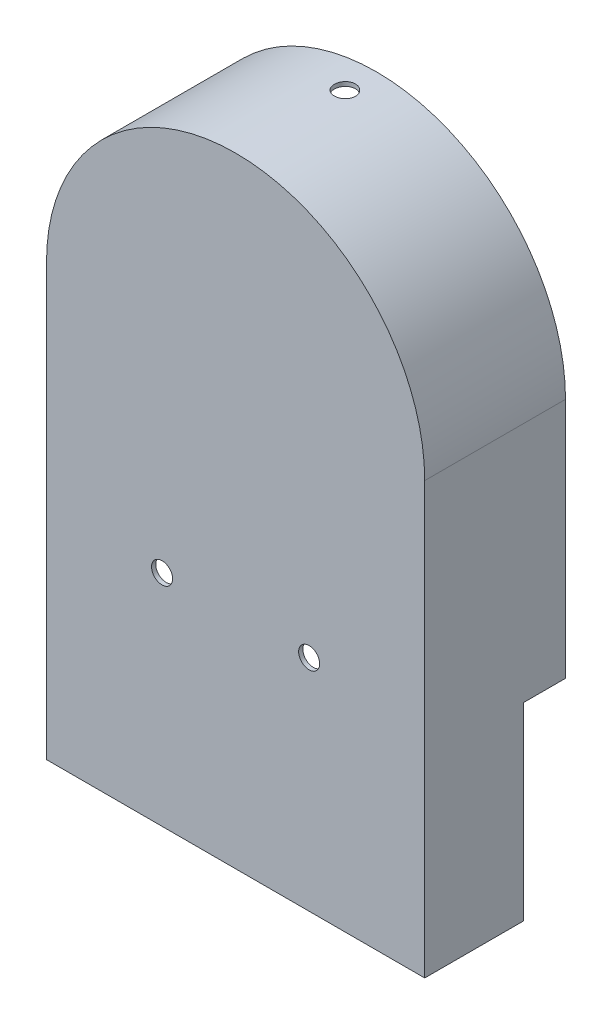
ISO-10303-21;
HEADER;
FILE_DESCRIPTION(('STEP AP214'),'2;1');
FILE_NAME('part.step','',(''),(''),'','','');
FILE_SCHEMA(('AUTOMOTIVE_DESIGN { 1 0 10303 214 1 1 1 1 }'));
ENDSEC;
DATA;
#1=APPLICATION_CONTEXT('core data for automotive mechanical design processes');
#2=APPLICATION_PROTOCOL_DEFINITION('international standard','automotive_design',2000,#1);
#3=PRODUCT_CONTEXT('',#1,'mechanical');
#4=PRODUCT('Part','Part','',(#3));
#5=PRODUCT_RELATED_PRODUCT_CATEGORY('part','',(#4));
#6=PRODUCT_DEFINITION_FORMATION('','',#4);
#7=PRODUCT_DEFINITION_CONTEXT('part definition',#1,'design');
#8=PRODUCT_DEFINITION('design','',#6,#7);
#9=PRODUCT_DEFINITION_SHAPE('','',#8);
#10=(LENGTH_UNIT() NAMED_UNIT(*) SI_UNIT(.MILLI.,.METRE.));
#11=(NAMED_UNIT(*) PLANE_ANGLE_UNIT() SI_UNIT($,.RADIAN.));
#12=(NAMED_UNIT(*) SI_UNIT($,.STERADIAN.) SOLID_ANGLE_UNIT());
#13=UNCERTAINTY_MEASURE_WITH_UNIT(LENGTH_MEASURE(1.E-05),#10,'distance_accuracy_value','');
#14=(GEOMETRIC_REPRESENTATION_CONTEXT(3) GLOBAL_UNCERTAINTY_ASSIGNED_CONTEXT((#13)) GLOBAL_UNIT_ASSIGNED_CONTEXT((#10,
#11,#12)) REPRESENTATION_CONTEXT('',''));
#15=CARTESIAN_POINT('',(0.,0.,0.));
#16=DIRECTION('',(0.,0.,1.));
#17=DIRECTION('',(1.,0.,0.));
#18=AXIS2_PLACEMENT_3D('',#15,#16,#17);
#19=CARTESIAN_POINT('',(0.,0.,2.));
#20=DIRECTION('',(0.,0.,-1.));
#21=DIRECTION('',(-1.,0.,0.));
#22=AXIS2_PLACEMENT_3D('',#19,#20,#21);
#23=CYLINDRICAL_SURFACE('',#22,90.);
#24=DIRECTION('',(0.,0.,-1.));
#25=VECTOR('',#24,1.);
#26=CARTESIAN_POINT('',(90.,0.,2.));
#27=LINE('',#26,#25);
#28=CARTESIAN_POINT('',(90.,0.,2.));
#29=VERTEX_POINT('',#28);
#30=CARTESIAN_POINT('',(90.,0.,-65.));
#31=VERTEX_POINT('',#30);
#32=EDGE_CURVE('E149',#29,#31,#27,.T.);
#33=ORIENTED_EDGE('',*,*,#32,.T.);
#34=CARTESIAN_POINT('',(0.,0.,-65.));
#35=DIRECTION('',(0.,0.,-1.));
#36=DIRECTION('',(-1.,0.,0.));
#37=AXIS2_PLACEMENT_3D('',#34,#35,#36);
#38=CIRCLE('',#37,90.);
#39=CARTESIAN_POINT('',(-90.,0.,-65.));
#40=VERTEX_POINT('',#39);
#41=EDGE_CURVE('E218',#40,#31,#38,.T.);
#42=ORIENTED_EDGE('',*,*,#41,.F.);
#43=DIRECTION('',(0.,0.,-1.));
#44=VECTOR('',#43,1.);
#45=CARTESIAN_POINT('',(-90.,0.,2.));
#46=LINE('',#45,#44);
#47=CARTESIAN_POINT('',(-90.,0.,2.));
#48=VERTEX_POINT('',#47);
#49=EDGE_CURVE('E144',#48,#40,#46,.T.);
#50=ORIENTED_EDGE('',*,*,#49,.F.);
#51=CARTESIAN_POINT('',(0.,0.,2.));
#52=DIRECTION('',(0.,0.,1.));
#53=DIRECTION('',(1.,0.,0.));
#54=AXIS2_PLACEMENT_3D('',#51,#52,#53);
#55=CIRCLE('',#54,90.);
#56=EDGE_CURVE('E224',#29,#48,#55,.T.);
#57=ORIENTED_EDGE('',*,*,#56,.F.);
#58=EDGE_LOOP('',(#33,#42,#50,#57));
#59=FACE_BOUND('',#58,.T.);
#60=CARTESIAN_POINT('',(0.,90.,-55.));
#61=CARTESIAN_POINT('',(-0.140360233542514,90.0000001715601,-55.0000011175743));
#62=CARTESIAN_POINT('',(-0.280702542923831,89.999670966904,-54.9940873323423));
#63=CARTESIAN_POINT('',(-0.560434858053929,89.9983637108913,-54.9704742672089));
#64=CARTESIAN_POINT('',(-0.699824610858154,89.9973854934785,-54.952771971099));
#65=CARTESIAN_POINT('',(-0.976731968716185,89.9948064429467,-54.9056841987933));
#66=CARTESIAN_POINT('',(-1.11424785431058,89.993205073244,-54.8762886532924));
#67=CARTESIAN_POINT('',(-1.38635929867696,89.989424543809,-54.8060129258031));
#68=CARTESIAN_POINT('',(-1.52095377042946,89.9872451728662,-54.7651285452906));
#69=CARTESIAN_POINT('',(-1.78609486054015,89.9823729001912,-54.6722137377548));
#70=CARTESIAN_POINT('',(-1.91664495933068,89.9796804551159,-54.6201932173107));
#71=CARTESIAN_POINT('',(-2.17294420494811,89.9738559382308,-54.5053347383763));
#72=CARTESIAN_POINT('',(-2.29869156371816,89.9707237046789,-54.4424927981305));
#73=CARTESIAN_POINT('',(-2.54436938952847,89.9641110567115,-54.3064934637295));
#74=CARTESIAN_POINT('',(-2.66430332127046,89.9606308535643,-54.2333423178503));
#75=CARTESIAN_POINT('',(-2.89763110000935,89.9534177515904,-54.0771862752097));
#76=CARTESIAN_POINT('',(-3.01102251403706,89.9496847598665,-53.9941777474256));
#77=CARTESIAN_POINT('',(-3.23049240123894,89.9420701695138,-53.8188556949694));
#78=CARTESIAN_POINT('',(-3.33656571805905,89.9381884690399,-53.7265357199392));
#79=CARTESIAN_POINT('',(-3.54059957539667,89.9303874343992,-53.53325749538));
#80=CARTESIAN_POINT('',(-3.63855710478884,89.926468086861,-53.4322960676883));
#81=CARTESIAN_POINT('',(-3.82559084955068,89.9187055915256,-53.2225138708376));
#82=CARTESIAN_POINT('',(-3.91466996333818,89.9148624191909,-53.1136956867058));
#83=CARTESIAN_POINT('',(-4.08338293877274,89.9073585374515,-52.8888995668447));
#84=CARTESIAN_POINT('',(-4.16301330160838,89.9036978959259,-52.7729190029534));
#85=CARTESIAN_POINT('',(-4.31224433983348,89.8966636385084,-52.5346235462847));
#86=CARTESIAN_POINT('',(-4.38184235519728,89.8932900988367,-52.4123069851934));
#87=CARTESIAN_POINT('',(-4.51051122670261,89.8869258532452,-52.1621927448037));
#88=CARTESIAN_POINT('',(-4.56957818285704,89.8839352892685,-52.0343930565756));
#89=CARTESIAN_POINT('',(-4.67671111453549,89.8784248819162,-51.7742988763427));
#90=CARTESIAN_POINT('',(-4.72478122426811,89.8759048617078,-51.6420060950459));
#91=CARTESIAN_POINT('',(-4.80961883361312,89.8714044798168,-51.3738214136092));
#92=CARTESIAN_POINT('',(-4.8463821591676,89.8694243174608,-51.2379282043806));
#93=CARTESIAN_POINT('',(-4.93916268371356,89.8643907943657,-50.8266749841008));
#94=CARTESIAN_POINT('',(-4.9778995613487,89.8622322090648,-50.5471835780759));
#95=CARTESIAN_POINT('',(-5.00788626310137,89.8605656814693,-49.9858093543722));
#96=CARTESIAN_POINT('',(-4.99913652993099,89.8610577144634,-49.7039265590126));
#97=CARTESIAN_POINT('',(-4.93450003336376,89.8646301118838,-49.1459148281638));
#98=CARTESIAN_POINT('',(-4.87866553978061,89.8677076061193,-48.8697798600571));
#99=CARTESIAN_POINT('',(-4.72150904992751,89.8761007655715,-48.3308188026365));
#100=CARTESIAN_POINT('',(-4.62018682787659,89.8814164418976,-48.0679927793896));
#101=CARTESIAN_POINT('',(-4.37487588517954,89.8936898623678,-47.5629287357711));
#102=CARTESIAN_POINT('',(-4.23086337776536,89.9006485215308,-47.320702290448));
#103=CARTESIAN_POINT('',(-3.9042759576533,89.9154228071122,-46.8638434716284));
#104=CARTESIAN_POINT('',(-3.72170070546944,89.9232384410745,-46.6492113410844));
#105=CARTESIAN_POINT('',(-3.32287594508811,89.9388585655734,-46.2533285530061));
#106=CARTESIAN_POINT('',(-3.10658117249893,89.9466630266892,-46.0721234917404));
#107=CARTESIAN_POINT('',(-2.64661601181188,89.9613710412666,-45.7485903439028));
#108=CARTESIAN_POINT('',(-2.40294561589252,89.9682745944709,-45.6062622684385));
#109=CARTESIAN_POINT('',(-1.89511905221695,89.9804032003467,-45.3645273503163));
#110=CARTESIAN_POINT('',(-1.63096209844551,89.9856281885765,-45.2651221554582));
#111=CARTESIAN_POINT('',(-1.08967290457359,89.9938099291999,-45.1120848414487));
#112=CARTESIAN_POINT('',(-0.81254078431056,89.9967667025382,-45.0584522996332));
#113=CARTESIAN_POINT('',(-0.253563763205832,90.0000761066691,-44.9985390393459));
#114=CARTESIAN_POINT('',(0.0282743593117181,90.0004322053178,-44.9921952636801));
#115=CARTESIAN_POINT('',(0.589010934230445,89.9985093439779,-45.0268749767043));
#116=CARTESIAN_POINT('',(0.867909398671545,89.9962303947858,-45.0678982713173));
#117=CARTESIAN_POINT('',(1.41467267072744,89.9892962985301,-45.1960954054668));
#118=CARTESIAN_POINT('',(1.68254426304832,89.9846426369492,-45.2832403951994));
#119=CARTESIAN_POINT('',(2.1998590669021,89.9734828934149,-45.5011779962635));
#120=CARTESIAN_POINT('',(2.4493021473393,89.9669767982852,-45.6319709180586));
#121=CARTESIAN_POINT('',(2.92296839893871,89.9528350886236,-45.9336524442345));
#122=CARTESIAN_POINT('',(3.14716465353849,89.9451982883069,-46.1045832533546));
#123=CARTESIAN_POINT('',(3.56370226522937,89.9296589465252,-46.4816278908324));
#124=CARTESIAN_POINT('',(3.75604337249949,89.9217564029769,-46.687741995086));
#125=CARTESIAN_POINT('',(4.10362407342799,89.9065662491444,-47.1295702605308));
#126=CARTESIAN_POINT('',(4.25882282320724,89.8992793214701,-47.3653165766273));
#127=CARTESIAN_POINT('',(4.52743255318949,89.8861531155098,-47.8595691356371));
#128=CARTESIAN_POINT('',(4.64084374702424,89.8803138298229,-48.1180752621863));
#129=CARTESIAN_POINT('',(4.8225935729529,89.8707455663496,-48.6503068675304));
#130=CARTESIAN_POINT('',(4.89095810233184,89.8670153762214,-48.9240235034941));
#131=CARTESIAN_POINT('',(4.9807379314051,89.8620852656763,-49.4792243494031));
#132=CARTESIAN_POINT('',(5.00215358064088,89.8608853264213,-49.7607085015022));
#133=CARTESIAN_POINT('',(4.99866262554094,89.8610775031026,-50.1821650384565));
#134=CARTESIAN_POINT('',(4.99156669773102,89.8614733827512,-50.3225028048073));
#135=CARTESIAN_POINT('',(4.96560006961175,89.8629123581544,-50.6020673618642));
#136=CARTESIAN_POINT('',(4.94673372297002,89.863955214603,-50.7412945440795));
#137=CARTESIAN_POINT('',(4.89734707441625,89.8666600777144,-51.017703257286));
#138=CARTESIAN_POINT('',(4.86682246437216,89.8683223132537,-51.1548840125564));
#139=CARTESIAN_POINT('',(4.79435436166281,89.8722175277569,-51.4261356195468));
#140=CARTESIAN_POINT('',(4.7524150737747,89.8744502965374,-51.5602075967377));
#141=CARTESIAN_POINT('',(4.65739412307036,89.8794244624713,-51.8243885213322));
#142=CARTESIAN_POINT('',(4.60430835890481,89.8821660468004,-51.9544959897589));
#143=CARTESIAN_POINT('',(4.48740416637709,89.8880783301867,-52.2097282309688));
#144=CARTESIAN_POINT('',(4.42358969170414,89.8912488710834,-52.3348548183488));
#145=CARTESIAN_POINT('',(4.28564477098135,89.8979311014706,-52.579332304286));
#146=CARTESIAN_POINT('',(4.21151084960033,89.9014429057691,-52.698681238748));
#147=CARTESIAN_POINT('',(4.05349867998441,89.9087059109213,-52.9306719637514));
#148=CARTESIAN_POINT('',(3.96962401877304,89.912457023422,-53.0433162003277));
#149=CARTESIAN_POINT('',(3.79255941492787,89.9200998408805,-53.2613256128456));
#150=CARTESIAN_POINT('',(3.69935468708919,89.9239917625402,-53.366678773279));
#151=CARTESIAN_POINT('',(3.5044397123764,89.9317986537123,-53.5691230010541));
#152=CARTESIAN_POINT('',(3.40273260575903,89.9357136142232,-53.6662170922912));
#153=CARTESIAN_POINT('',(3.19143798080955,89.9434594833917,-53.8515561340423));
#154=CARTESIAN_POINT('',(3.08184565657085,89.9472903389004,-53.9397956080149));
#155=CARTESIAN_POINT('',(2.855654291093,89.9547554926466,-54.1067001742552));
#156=CARTESIAN_POINT('',(2.7390578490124,89.9583898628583,-54.1853687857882));
#157=CARTESIAN_POINT('',(2.4994738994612,89.9653656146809,-54.33271698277));
#158=CARTESIAN_POINT('',(2.37647740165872,89.9687065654,-54.40138197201));
#159=CARTESIAN_POINT('',(2.12516973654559,89.974993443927,-54.5280733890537));
#160=CARTESIAN_POINT('',(1.99686053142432,89.9779395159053,-54.586103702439));
#161=CARTESIAN_POINT('',(1.73590822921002,89.9833519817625,-54.6910961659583));
#162=CARTESIAN_POINT('',(1.603269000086,89.9858187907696,-54.7380679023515));
#163=CARTESIAN_POINT('',(1.33454052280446,89.9902053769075,-54.8206597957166));
#164=CARTESIAN_POINT('',(1.19845217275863,89.9921252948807,-54.8562828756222));
#165=CARTESIAN_POINT('',(0.886966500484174,89.995797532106,-54.9239235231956));
#166=CARTESIAN_POINT('',(0.71079278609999,89.9973676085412,-54.9524270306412));
#167=CARTESIAN_POINT('',(0.356403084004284,89.9994687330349,-54.9904645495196));
#168=CARTESIAN_POINT('',(0.178187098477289,89.9999997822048,-54.9999985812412));
#169=CARTESIAN_POINT('',(0.,90.,-55.));
#170=B_SPLINE_CURVE_WITH_KNOTS('',3,(#60,#61,#62,#63,#64,#65,#66,#67,#68,#69,#70,#71,#72,#73,
#74,#75,#76,#77,#78,#79,#80,#81,#82,#83,#84,#85,#86,#87,#88,#89,#90,#91,#92,#93,#94,#95,#96,#97,
#98,#99,#100,#101,#102,#103,#104,#105,#106,#107,#108,#109,#110,#111,#112,#113,#114,#115,#116,
#117,#118,#119,#120,#121,#122,#123,#124,#125,#126,#127,#128,#129,#130,#131,#132,#133,#134,#135,
#136,#137,#138,#139,#140,#141,#142,#143,#144,#145,#146,#147,#148,#149,#150,#151,#152,#153,#154,
#155,#156,#157,#158,#159,#160,#161,#162,#163,#164,#165,#166,#167,#168,#169),.UNSPECIFIED.,.T.,
.F.,(4,2,2,2,2,2,2,2,2,2,2,2,2,2,2,2,2,2,2,2,2,2,2,2,2,2,2,2,2,2,2,2,2,2,2,2,2,2,2,2,2,2,2,2,2,
2,2,2,2,2,2,2,2,2,4),(0.,0.420925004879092,0.841957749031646,1.26335384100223,1.68490413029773,
2.10608096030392,2.52741309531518,2.94849095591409,3.36972440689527,3.79125169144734,
4.21293467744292,4.63447954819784,5.05618003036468,5.47799211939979,5.89996009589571,
6.32176917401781,6.74373378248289,7.58587641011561,8.4280111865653,9.26921231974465,
10.1104176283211,10.9520925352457,11.7937748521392,12.6365969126,13.4794192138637,
14.3222738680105,15.1651207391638,16.0068435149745,16.8485628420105,17.6897562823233,
18.5309557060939,19.3730436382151,20.2151381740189,21.0581545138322,21.9011665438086,
22.7436935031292,23.5862141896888,24.0073574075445,24.4283449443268,24.8494882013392,
25.2704765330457,25.69162003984,26.1126086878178,26.5337394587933,26.9547156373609,
27.3763698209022,27.7978689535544,28.2196271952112,28.6412298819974,29.0634416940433,
29.4854989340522,29.9071889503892,30.3287702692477,30.8631344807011,31.3974981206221),.UNSPECIFIED.);
#171=CARTESIAN_POINT('',(0.,90.,-55.));
#172=VERTEX_POINT('',#171);
#173=EDGE_CURVE('E164',#172,#172,#170,.T.);
#174=ORIENTED_EDGE('',*,*,#173,.F.);
#175=EDGE_LOOP('',(#174));
#176=FACE_BOUND('',#175,.T.);
#177=ADVANCED_FACE('F24',(#59,#176),#23,.T.);
#178=CARTESIAN_POINT('',(0.,0.,-65.));
#179=DIRECTION('',(0.,0.,1.));
#180=DIRECTION('',(1.,0.,0.));
#181=AXIS2_PLACEMENT_3D('',#178,#179,#180);
#182=CYLINDRICAL_SURFACE('',#181,88.);
#183=CARTESIAN_POINT('',(0.,0.,0.));
#184=DIRECTION('',(0.,0.,-1.));
#185=DIRECTION('',(-1.,0.,0.));
#186=AXIS2_PLACEMENT_3D('',#183,#184,#185);
#187=CIRCLE('',#186,88.);
#188=CARTESIAN_POINT('',(-88.,0.,0.));
#189=VERTEX_POINT('',#188);
#190=CARTESIAN_POINT('',(88.,0.,0.));
#191=VERTEX_POINT('',#190);
#192=EDGE_CURVE('E195',#189,#191,#187,.T.);
#193=ORIENTED_EDGE('',*,*,#192,.F.);
#194=DIRECTION('',(0.,0.,1.));
#195=VECTOR('',#194,1.);
#196=CARTESIAN_POINT('',(-88.,0.,-65.));
#197=LINE('',#196,#195);
#198=CARTESIAN_POINT('',(-88.,0.,-65.));
#199=VERTEX_POINT('',#198);
#200=EDGE_CURVE('E212',#199,#189,#197,.T.);
#201=ORIENTED_EDGE('',*,*,#200,.F.);
#202=CARTESIAN_POINT('',(0.,0.,-65.));
#203=DIRECTION('',(0.,0.,-1.));
#204=DIRECTION('',(-1.,0.,0.));
#205=AXIS2_PLACEMENT_3D('',#202,#203,#204);
#206=CIRCLE('',#205,88.);
#207=CARTESIAN_POINT('',(88.,0.,-65.));
#208=VERTEX_POINT('',#207);
#209=EDGE_CURVE('E203',#199,#208,#206,.T.);
#210=ORIENTED_EDGE('',*,*,#209,.T.);
#211=DIRECTION('',(0.,0.,1.));
#212=VECTOR('',#211,1.);
#213=CARTESIAN_POINT('',(88.,0.,-65.));
#214=LINE('',#213,#212);
#215=EDGE_CURVE('E210',#208,#191,#214,.T.);
#216=ORIENTED_EDGE('',*,*,#215,.T.);
#217=EDGE_LOOP('',(#193,#201,#210,#216));
#218=FACE_BOUND('',#217,.T.);
#219=CARTESIAN_POINT('',(0.,88.,-55.));
#220=CARTESIAN_POINT('',(-0.140354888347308,88.0000001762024,-55.0000011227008));
#221=CARTESIAN_POINT('',(-0.280691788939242,87.9996635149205,-54.9940877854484));
#222=CARTESIAN_POINT('',(-0.560413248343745,87.9983266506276,-54.9704765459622));
#223=CARTESIAN_POINT('',(-0.699797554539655,87.9973262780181,-54.9527756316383));
#224=CARTESIAN_POINT('',(-0.976693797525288,87.9946888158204,-54.9056916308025));
#225=CARTESIAN_POINT('',(-1.11420401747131,87.9930511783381,-54.8762984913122));
#226=CARTESIAN_POINT('',(-1.3863041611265,87.9891850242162,-54.8060286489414));
#227=CARTESIAN_POINT('',(-1.52089299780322,87.9869562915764,-54.7651477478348));
#228=CARTESIAN_POINT('',(-1.78602270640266,87.98197366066,-54.6722411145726));
#229=CARTESIAN_POINT('',(-1.91656706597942,87.9792202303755,-54.6202253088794));
#230=CARTESIAN_POINT('',(-2.17285514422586,87.9732637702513,-54.5053774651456));
#231=CARTESIAN_POINT('',(-2.29859707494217,87.9700605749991,-54.4425414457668));
#232=CARTESIAN_POINT('',(-2.54426465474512,87.9632980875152,-54.3065550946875));
#233=CARTESIAN_POINT('',(-2.66419376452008,87.9597390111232,-54.233411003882));
#234=CARTESIAN_POINT('',(-2.8975126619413,87.952362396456,-54.0772701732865));
#235=CARTESIAN_POINT('',(-3.01090001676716,87.9485447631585,-53.9942698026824));
#236=CARTESIAN_POINT('',(-3.23036763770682,87.9407572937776,-53.8189611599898));
#237=CARTESIAN_POINT('',(-3.33644242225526,87.936787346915,-53.7266460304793));
#238=CARTESIAN_POINT('',(-3.54047971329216,87.9288088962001,-53.5333775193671));
#239=CARTESIAN_POINT('',(-3.63843920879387,87.9248003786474,-53.4324209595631));
#240=CARTESIAN_POINT('',(-3.82547749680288,87.9168612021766,-53.2226483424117));
#241=CARTESIAN_POINT('',(-3.91455918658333,87.9129305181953,-53.1138348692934));
#242=CARTESIAN_POINT('',(-4.08327796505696,87.905255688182,-52.889047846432));
#243=CARTESIAN_POINT('',(-4.16291155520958,87.9015116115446,-52.7730716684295));
#244=CARTESIAN_POINT('',(-4.31215194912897,87.8943168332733,-52.5347808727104));
#245=CARTESIAN_POINT('',(-4.38175578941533,87.8908662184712,-52.4124643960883));
#246=CARTESIAN_POINT('',(-4.51043624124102,87.8843564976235,-52.1623493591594));
#247=CARTESIAN_POINT('',(-4.56950895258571,87.8812975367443,-52.0345487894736));
#248=CARTESIAN_POINT('',(-4.67665315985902,87.875661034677,-51.7744518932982));
#249=CARTESIAN_POINT('',(-4.7247287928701,87.8730833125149,-51.6421572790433));
#250=CARTESIAN_POINT('',(-4.80957707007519,87.8684798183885,-51.373968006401));
#251=CARTESIAN_POINT('',(-4.84634554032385,87.8664542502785,-51.238072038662));
#252=CARTESIAN_POINT('',(-4.93913770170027,87.8613053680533,-50.8268224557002));
#253=CARTESIAN_POINT('',(-4.97788248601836,87.8590971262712,-50.5473367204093));
#254=CARTESIAN_POINT('',(-5.00788647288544,87.8573916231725,-49.9859720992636));
#255=CARTESIAN_POINT('',(-4.99914613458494,87.8578943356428,-49.704093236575));
#256=CARTESIAN_POINT('',(-4.93453147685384,87.8615469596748,-49.1461027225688));
#257=CARTESIAN_POINT('',(-4.87871183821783,87.8646938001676,-48.8699847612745));
#258=CARTESIAN_POINT('',(-4.72159142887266,87.8732764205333,-48.3310552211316));
#259=CARTESIAN_POINT('',(-4.62029042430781,87.8787122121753,-48.0682437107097));
#260=CARTESIAN_POINT('',(-4.37502497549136,87.8912633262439,-47.5631980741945));
#261=CARTESIAN_POINT('',(-4.23103565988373,87.8983796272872,-47.3209760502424));
#262=CARTESIAN_POINT('',(-3.90449780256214,87.9134888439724,-46.8641210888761));
#263=CARTESIAN_POINT('',(-3.72194890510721,87.9214817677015,-46.6494884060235));
#264=CARTESIAN_POINT('',(-3.32316574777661,87.9374570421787,-46.2535855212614));
#265=CARTESIAN_POINT('',(-3.10688413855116,87.9454393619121,-46.0723630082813));
#266=CARTESIAN_POINT('',(-2.64694110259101,87.9604829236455,-45.7487926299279));
#267=CARTESIAN_POINT('',(-2.40327966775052,87.9675441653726,-45.6064447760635));
#268=CARTESIAN_POINT('',(-1.89546522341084,87.9799502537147,-45.3646686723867));
#269=CARTESIAN_POINT('',(-1.63131138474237,87.9852950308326,-45.2652421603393));
#270=CARTESIAN_POINT('',(-1.09002313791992,87.9936649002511,-45.1121626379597));
#271=CARTESIAN_POINT('',(-0.812888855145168,87.9966900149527,-45.0585091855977));
#272=CARTESIAN_POINT('',(-0.253920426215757,88.0000767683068,-44.9985577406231));
#273=CARTESIAN_POINT('',(0.0279066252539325,88.0004421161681,-44.992193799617));
#274=CARTESIAN_POINT('',(0.58862440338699,87.9984780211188,-45.0268298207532));
#275=CARTESIAN_POINT('',(0.867515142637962,87.9961485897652,-45.0678295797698));
#276=CARTESIAN_POINT('',(1.41425830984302,87.9890596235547,-45.1959745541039));
#277=CARTESIAN_POINT('',(1.68211783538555,87.9843016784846,-45.2830895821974));
#278=CARTESIAN_POINT('',(2.19941388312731,87.9728911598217,-45.5009616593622));
#279=CARTESIAN_POINT('',(2.44885026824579,87.9662385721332,-45.6317190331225));
#280=CARTESIAN_POINT('',(2.92252187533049,87.9517774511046,-45.9333321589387));
#281=CARTESIAN_POINT('',(3.14672896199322,87.9439676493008,-46.1042320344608));
#282=CARTESIAN_POINT('',(3.56329438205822,87.9280755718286,-46.481215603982));
#283=CARTESIAN_POINT('',(3.75565245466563,87.9199932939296,-46.6872995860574));
#284=CARTESIAN_POINT('',(4.10328264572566,87.904456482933,-47.1290817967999));
#285=CARTESIAN_POINT('',(4.25851203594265,87.8970026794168,-47.3648136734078));
#286=CARTESIAN_POINT('',(4.52718482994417,87.8835751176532,-47.8590445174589));
#287=CARTESIAN_POINT('',(4.64062845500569,87.8776013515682,-48.1175433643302));
#288=CARTESIAN_POINT('',(4.82244077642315,87.8678120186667,-48.6497610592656));
#289=CARTESIAN_POINT('',(4.89083652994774,87.8639951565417,-48.9234706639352));
#290=CARTESIAN_POINT('',(4.98067935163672,87.8589492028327,-49.4786638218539));
#291=CARTESIAN_POINT('',(5.00212678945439,87.8577200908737,-49.7601473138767));
#292=CARTESIAN_POINT('',(4.99868303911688,87.8579139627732,-50.181597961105));
#293=CARTESIAN_POINT('',(4.99160354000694,87.8583179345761,-50.3219285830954));
#294=CARTESIAN_POINT('',(4.96567099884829,87.8597878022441,-50.6014802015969));
#295=CARTESIAN_POINT('',(4.94682231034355,87.8608534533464,-50.7407015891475));
#296=CARTESIAN_POINT('',(4.89747214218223,87.8636179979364,-51.0171000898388));
#297=CARTESIAN_POINT('',(4.86696635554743,87.8653171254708,-51.1542764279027));
#298=CARTESIAN_POINT('',(4.79453699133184,87.8692991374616,-51.4255206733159));
#299=CARTESIAN_POINT('',(4.75261761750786,87.8715818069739,-51.5595897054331));
#300=CARTESIAN_POINT('',(4.65763760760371,87.8766673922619,-51.8237661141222));
#301=CARTESIAN_POINT('',(4.60457288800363,87.8794704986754,-51.9538720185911));
#302=CARTESIAN_POINT('',(4.48771174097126,87.8855156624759,-52.2091029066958));
#303=CARTESIAN_POINT('',(4.42391926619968,87.8887575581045,-52.3342297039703));
#304=CARTESIAN_POINT('',(4.28601914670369,87.8955903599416,-52.5787096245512));
#305=CARTESIAN_POINT('',(4.21190802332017,87.8991813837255,-52.6980607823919));
#306=CARTESIAN_POINT('',(4.05394203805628,87.9066084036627,-52.9300581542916));
#307=CARTESIAN_POINT('',(3.9700907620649,87.9104443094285,-53.0427068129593));
#308=CARTESIAN_POINT('',(3.79306781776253,87.9182603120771,-53.2607342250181));
#309=CARTESIAN_POINT('',(3.699880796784,87.9222406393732,-53.3661005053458));
#310=CARTESIAN_POINT('',(3.50500019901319,87.9302250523,-53.5685725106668));
#311=CARTESIAN_POINT('',(3.40330976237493,87.9342291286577,-53.6656812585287));
#312=CARTESIAN_POINT('',(3.1920472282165,87.9421515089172,-53.8510511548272));
#313=CARTESIAN_POINT('',(3.08247032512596,87.9460697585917,-53.939306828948));
#314=CARTESIAN_POINT('',(2.85630826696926,87.9537054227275,-54.1062452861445));
#315=CARTESIAN_POINT('',(2.73972571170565,87.957422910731,-54.1849315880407));
#316=CARTESIAN_POINT('',(2.50016439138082,87.9645585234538,-54.332318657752));
#317=CARTESIAN_POINT('',(2.37717645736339,87.96797619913,-54.4010045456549));
#318=CARTESIAN_POINT('',(2.12588365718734,87.9744076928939,-54.5277383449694));
#319=CARTESIAN_POINT('',(1.99758075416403,87.9774216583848,-54.5857901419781));
#320=CARTESIAN_POINT('',(1.7366385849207,87.9829591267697,-54.69082594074));
#321=CARTESIAN_POINT('',(1.60400318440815,87.9854830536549,-54.7378195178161));
#322=CARTESIAN_POINT('',(1.33528004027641,87.9899715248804,-54.8204551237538));
#323=CARTESIAN_POINT('',(1.19919319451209,87.9919362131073,-54.8561000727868));
#324=CARTESIAN_POINT('',(0.887590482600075,87.9956959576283,-54.9238156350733));
#325=CARTESIAN_POINT('',(0.711294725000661,87.9973039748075,-54.9523595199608));
#326=CARTESIAN_POINT('',(0.35665629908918,87.9994558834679,-54.9904509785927));
#327=CARTESIAN_POINT('',(0.178313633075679,87.999999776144,-54.9999985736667));
#328=CARTESIAN_POINT('',(0.,88.,-55.));
#329=B_SPLINE_CURVE_WITH_KNOTS('',3,(#219,#220,#221,#222,#223,#224,#225,#226,#227,#228,#229,
#230,#231,#232,#233,#234,#235,#236,#237,#238,#239,#240,#241,#242,#243,#244,#245,#246,#247,#248,
#249,#250,#251,#252,#253,#254,#255,#256,#257,#258,#259,#260,#261,#262,#263,#264,#265,#266,#267,
#268,#269,#270,#271,#272,#273,#274,#275,#276,#277,#278,#279,#280,#281,#282,#283,#284,#285,#286,
#287,#288,#289,#290,#291,#292,#293,#294,#295,#296,#297,#298,#299,#300,#301,#302,#303,#304,#305,
#306,#307,#308,#309,#310,#311,#312,#313,#314,#315,#316,#317,#318,#319,#320,#321,#322,#323,#324,
#325,#326,#327,#328),.UNSPECIFIED.,.T.,.F.,(4,2,2,2,2,2,2,2,2,2,2,2,2,2,2,2,2,2,2,2,2,2,2,2,2,2,
2,2,2,2,2,2,2,2,2,2,2,2,2,2,2,2,2,2,2,2,2,2,2,2,2,2,2,2,4),(0.,0.420908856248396,
0.841925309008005,1.26330453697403,1.68483795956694,2.10599715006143,2.52731164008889,
2.94837213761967,3.36958822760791,3.79111670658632,4.21280088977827,4.63434700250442,
5.05604872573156,5.47787479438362,5.89985676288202,6.32167972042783,6.74365820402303,
7.58578806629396,8.42790978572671,9.26905475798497,10.1102040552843,10.9518443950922,
11.7934925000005,12.6363328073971,13.4791733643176,14.32204804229,15.1649145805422,
16.00660546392,16.8482927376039,17.6894297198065,18.5305729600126,19.3726451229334,
20.2147241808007,21.0577677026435,21.9008067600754,22.7433389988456,23.5858646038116,
24.0069840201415,24.4279477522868,24.8490671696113,25.2700316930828,25.6911507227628,
26.1121149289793,26.5332213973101,26.9541733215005,27.3758292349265,27.7973301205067,
28.2190900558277,28.6406944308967,29.0629198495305,29.484990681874,29.9066946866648,
30.3282900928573,30.8630336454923,31.3977765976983),.UNSPECIFIED.);
#330=CARTESIAN_POINT('',(0.,88.,-55.));
#331=VERTEX_POINT('',#330);
#332=EDGE_CURVE('E28',#331,#331,#329,.T.);
#333=ORIENTED_EDGE('',*,*,#332,.T.);
#334=EDGE_LOOP('',(#333));
#335=FACE_BOUND('',#334,.T.);
#336=ADVANCED_FACE('F254',(#218,#335),#182,.F.);
#337=CARTESIAN_POINT('',(-90.,-205.,2.));
#338=DIRECTION('',(1.,0.,0.));
#339=DIRECTION('',(0.,0.,-1.));
#340=AXIS2_PLACEMENT_3D('',#337,#338,#339);
#341=PLANE('',#340);
#342=DIRECTION('',(0.,1.,0.));
#343=VECTOR('',#342,1.);
#344=CARTESIAN_POINT('',(-90.,-205.,-65.));
#345=LINE('',#344,#343);
#346=CARTESIAN_POINT('',(-90.,-115.,-65.));
#347=VERTEX_POINT('',#346);
#348=EDGE_CURVE('E216',#347,#40,#345,.T.);
#349=ORIENTED_EDGE('',*,*,#348,.F.);
#350=DIRECTION('',(0.,0.,-1.));
#351=VECTOR('',#350,1.);
#352=CARTESIAN_POINT('',(-90.,-115.,-65.));
#353=LINE('',#352,#351);
#354=CARTESIAN_POINT('',(-90.,-115.,-45.));
#355=VERTEX_POINT('',#354);
#356=EDGE_CURVE('E139',#355,#347,#353,.T.);
#357=ORIENTED_EDGE('',*,*,#356,.F.);
#358=DIRECTION('',(0.,1.,0.));
#359=VECTOR('',#358,1.);
#360=CARTESIAN_POINT('',(-90.,-205.,-45.));
#361=LINE('',#360,#359);
#362=CARTESIAN_POINT('',(-90.,-205.,-45.));
#363=VERTEX_POINT('',#362);
#364=EDGE_CURVE('E122',#363,#355,#361,.T.);
#365=ORIENTED_EDGE('',*,*,#364,.F.);
#366=DIRECTION('',(0.,0.,-1.));
#367=VECTOR('',#366,1.);
#368=CARTESIAN_POINT('',(-90.,-205.,2.));
#369=LINE('',#368,#367);
#370=CARTESIAN_POINT('',(-90.,-205.,2.));
#371=VERTEX_POINT('',#370);
#372=EDGE_CURVE('E137',#371,#363,#369,.T.);
#373=ORIENTED_EDGE('',*,*,#372,.F.);
#374=DIRECTION('',(0.,-1.,0.));
#375=VECTOR('',#374,1.);
#376=CARTESIAN_POINT('',(-90.,-205.,2.));
#377=LINE('',#376,#375);
#378=EDGE_CURVE('E227',#48,#371,#377,.T.);
#379=ORIENTED_EDGE('',*,*,#378,.F.);
#380=ORIENTED_EDGE('',*,*,#49,.T.);
#381=EDGE_LOOP('',(#349,#357,#365,#373,#379,#380));
#382=FACE_BOUND('',#381,.T.);
#383=ADVANCED_FACE('F136',(#382),#341,.F.);
#384=CARTESIAN_POINT('',(90.,-205.,2.));
#385=DIRECTION('',(0.,1.,0.));
#386=DIRECTION('',(-1.,0.,0.));
#387=AXIS2_PLACEMENT_3D('',#384,#385,#386);
#388=PLANE('',#387);
#389=ORIENTED_EDGE('',*,*,#372,.T.);
#390=DIRECTION('',(-1.,0.,0.));
#391=VECTOR('',#390,1.);
#392=CARTESIAN_POINT('',(90.,-205.,-45.));
#393=LINE('',#392,#391);
#394=CARTESIAN_POINT('',(90.,-205.,-45.));
#395=VERTEX_POINT('',#394);
#396=EDGE_CURVE('E118',#395,#363,#393,.T.);
#397=ORIENTED_EDGE('',*,*,#396,.F.);
#398=DIRECTION('',(0.,0.,-1.));
#399=VECTOR('',#398,1.);
#400=CARTESIAN_POINT('',(90.,-205.,2.));
#401=LINE('',#400,#399);
#402=CARTESIAN_POINT('',(90.,-205.,2.));
#403=VERTEX_POINT('',#402);
#404=EDGE_CURVE('E145',#403,#395,#401,.T.);
#405=ORIENTED_EDGE('',*,*,#404,.F.);
#406=DIRECTION('',(1.,0.,0.));
#407=VECTOR('',#406,1.);
#408=CARTESIAN_POINT('',(90.,-205.,2.));
#409=LINE('',#408,#407);
#410=EDGE_CURVE('E143',#371,#403,#409,.T.);
#411=ORIENTED_EDGE('',*,*,#410,.F.);
#412=EDGE_LOOP('',(#389,#397,#405,#411));
#413=FACE_BOUND('',#412,.T.);
#414=ADVANCED_FACE('F142',(#413),#388,.F.);
#415=CARTESIAN_POINT('',(90.,0.,2.));
#416=DIRECTION('',(-1.,0.,0.));
#417=DIRECTION('',(0.,-1.,0.));
#418=AXIS2_PLACEMENT_3D('',#415,#416,#417);
#419=PLANE('',#418);
#420=DIRECTION('',(0.,1.,0.));
#421=VECTOR('',#420,1.);
#422=CARTESIAN_POINT('',(90.,-205.,-45.));
#423=LINE('',#422,#421);
#424=CARTESIAN_POINT('',(90.,-115.,-45.));
#425=VERTEX_POINT('',#424);
#426=EDGE_CURVE('E125',#395,#425,#423,.T.);
#427=ORIENTED_EDGE('',*,*,#426,.T.);
#428=DIRECTION('',(0.,0.,-1.));
#429=VECTOR('',#428,1.);
#430=CARTESIAN_POINT('',(90.,-115.,-65.));
#431=LINE('',#430,#429);
#432=CARTESIAN_POINT('',(90.,-115.,-65.));
#433=VERTEX_POINT('',#432);
#434=EDGE_CURVE('E131',#425,#433,#431,.T.);
#435=ORIENTED_EDGE('',*,*,#434,.T.);
#436=DIRECTION('',(0.,-1.,0.));
#437=VECTOR('',#436,1.);
#438=CARTESIAN_POINT('',(90.,-205.,-65.));
#439=LINE('',#438,#437);
#440=EDGE_CURVE('E221',#31,#433,#439,.T.);
#441=ORIENTED_EDGE('',*,*,#440,.F.);
#442=ORIENTED_EDGE('',*,*,#32,.F.);
#443=DIRECTION('',(0.,1.,0.));
#444=VECTOR('',#443,1.);
#445=CARTESIAN_POINT('',(90.,0.,2.));
#446=LINE('',#445,#444);
#447=EDGE_CURVE('E230',#403,#29,#446,.T.);
#448=ORIENTED_EDGE('',*,*,#447,.F.);
#449=ORIENTED_EDGE('',*,*,#404,.T.);
#450=EDGE_LOOP('',(#427,#435,#441,#442,#448,#449));
#451=FACE_BOUND('',#450,.T.);
#452=ADVANCED_FACE('F243',(#451),#419,.F.);
#453=CARTESIAN_POINT('',(0.,0.,2.));
#454=DIRECTION('',(0.,0.,1.));
#455=DIRECTION('',(1.,0.,0.));
#456=AXIS2_PLACEMENT_3D('',#453,#454,#455);
#457=PLANE('',#456);
#458=CARTESIAN_POINT('',(-35.,-100.5,2.));
#459=DIRECTION('',(0.,0.,1.));
#460=DIRECTION('',(1.,0.,0.));
#461=AXIS2_PLACEMENT_3D('',#458,#459,#460);
#462=CIRCLE('',#461,5.);
#463=CARTESIAN_POINT('',(-30.,-100.5,2.));
#464=VERTEX_POINT('',#463);
#465=EDGE_CURVE('E158',#464,#464,#462,.T.);
#466=ORIENTED_EDGE('',*,*,#465,.F.);
#467=EDGE_LOOP('',(#466));
#468=FACE_BOUND('',#467,.T.);
#469=CARTESIAN_POINT('',(35.,-100.5,2.));
#470=DIRECTION('',(0.,0.,1.));
#471=DIRECTION('',(1.,0.,0.));
#472=AXIS2_PLACEMENT_3D('',#469,#470,#471);
#473=CIRCLE('',#472,5.);
#474=CARTESIAN_POINT('',(40.,-100.5,2.));
#475=VERTEX_POINT('',#474);
#476=EDGE_CURVE('E155',#475,#475,#473,.T.);
#477=ORIENTED_EDGE('',*,*,#476,.F.);
#478=EDGE_LOOP('',(#477));
#479=FACE_BOUND('',#478,.T.);
#480=ORIENTED_EDGE('',*,*,#56,.T.);
#481=ORIENTED_EDGE('',*,*,#378,.T.);
#482=ORIENTED_EDGE('',*,*,#410,.T.);
#483=ORIENTED_EDGE('',*,*,#447,.T.);
#484=EDGE_LOOP('',(#480,#481,#482,#483));
#485=FACE_BOUND('',#484,.T.);
#486=ADVANCED_FACE('F298',(#468,#479,#485),#457,.T.);
#487=CARTESIAN_POINT('',(0.,0.,-65.));
#488=DIRECTION('',(0.,0.,-1.));
#489=DIRECTION('',(-1.,0.,0.));
#490=AXIS2_PLACEMENT_3D('',#487,#488,#489);
#491=PLANE('',#490);
#492=DIRECTION('',(-1.,0.,0.));
#493=VECTOR('',#492,1.);
#494=CARTESIAN_POINT('',(90.,-115.,-65.));
#495=LINE('',#494,#493);
#496=CARTESIAN_POINT('',(-87.9999999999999,-115.,-65.));
#497=VERTEX_POINT('',#496);
#498=EDGE_CURVE('E180',#497,#347,#495,.T.);
#499=ORIENTED_EDGE('',*,*,#498,.T.);
#500=ORIENTED_EDGE('',*,*,#348,.T.);
#501=ORIENTED_EDGE('',*,*,#41,.T.);
#502=ORIENTED_EDGE('',*,*,#440,.T.);
#503=CARTESIAN_POINT('',(88.,-115.,-65.));
#504=VERTEX_POINT('',#503);
#505=EDGE_CURVE('E177',#433,#504,#495,.T.);
#506=ORIENTED_EDGE('',*,*,#505,.T.);
#507=DIRECTION('',(0.,-1.,0.));
#508=VECTOR('',#507,1.);
#509=CARTESIAN_POINT('',(88.,-203.,-65.));
#510=LINE('',#509,#508);
#511=EDGE_CURVE('E206',#208,#504,#510,.T.);
#512=ORIENTED_EDGE('',*,*,#511,.F.);
#513=ORIENTED_EDGE('',*,*,#209,.F.);
#514=DIRECTION('',(0.,1.,0.));
#515=VECTOR('',#514,1.);
#516=CARTESIAN_POINT('',(-88.,-203.,-65.));
#517=LINE('',#516,#515);
#518=EDGE_CURVE('E201',#497,#199,#517,.T.);
#519=ORIENTED_EDGE('',*,*,#518,.F.);
#520=EDGE_LOOP('',(#499,#500,#501,#502,#506,#512,#513,#519));
#521=FACE_BOUND('',#520,.T.);
#522=ADVANCED_FACE('F242',(#521),#491,.T.);
#523=CARTESIAN_POINT('',(-88.,-203.,-65.));
#524=DIRECTION('',(0.,1.,0.));
#525=DIRECTION('',(-1.,0.,0.));
#526=AXIS2_PLACEMENT_3D('',#523,#524,#525);
#527=PLANE('',#526);
#528=DIRECTION('',(1.,0.,0.));
#529=VECTOR('',#528,1.);
#530=CARTESIAN_POINT('',(-88.,-203.,-45.));
#531=LINE('',#530,#529);
#532=CARTESIAN_POINT('',(-88.,-203.,-45.));
#533=VERTEX_POINT('',#532);
#534=CARTESIAN_POINT('',(88.,-203.,-45.));
#535=VERTEX_POINT('',#534);
#536=EDGE_CURVE('E45',#533,#535,#531,.T.);
#537=ORIENTED_EDGE('',*,*,#536,.F.);
#538=DIRECTION('',(0.,0.,1.));
#539=VECTOR('',#538,1.);
#540=CARTESIAN_POINT('',(-88.,-203.,-65.));
#541=LINE('',#540,#539);
#542=CARTESIAN_POINT('',(-88.,-203.,0.));
#543=VERTEX_POINT('',#542);
#544=EDGE_CURVE('E214',#533,#543,#541,.T.);
#545=ORIENTED_EDGE('',*,*,#544,.T.);
#546=DIRECTION('',(-1.,0.,0.));
#547=VECTOR('',#546,1.);
#548=CARTESIAN_POINT('',(-88.,-203.,0.));
#549=LINE('',#548,#547);
#550=CARTESIAN_POINT('',(88.,-203.,0.));
#551=VERTEX_POINT('',#550);
#552=EDGE_CURVE('E189',#551,#543,#549,.T.);
#553=ORIENTED_EDGE('',*,*,#552,.F.);
#554=DIRECTION('',(0.,0.,1.));
#555=VECTOR('',#554,1.);
#556=CARTESIAN_POINT('',(88.,-203.,-65.));
#557=LINE('',#556,#555);
#558=EDGE_CURVE('E52',#535,#551,#557,.T.);
#559=ORIENTED_EDGE('',*,*,#558,.F.);
#560=EDGE_LOOP('',(#537,#545,#553,#559));
#561=FACE_BOUND('',#560,.T.);
#562=ADVANCED_FACE('F266',(#561),#527,.T.);
#563=CARTESIAN_POINT('',(-88.,-203.,-65.));
#564=DIRECTION('',(1.,0.,0.));
#565=DIRECTION('',(0.,0.,-1.));
#566=AXIS2_PLACEMENT_3D('',#563,#564,#565);
#567=PLANE('',#566);
#568=DIRECTION('',(0.,0.,1.));
#569=VECTOR('',#568,1.);
#570=CARTESIAN_POINT('',(-88.,-115.,-65.));
#571=LINE('',#570,#569);
#572=CARTESIAN_POINT('',(-87.9999999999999,-115.,-45.));
#573=VERTEX_POINT('',#572);
#574=EDGE_CURVE('E187',#497,#573,#571,.T.);
#575=ORIENTED_EDGE('',*,*,#574,.F.);
#576=ORIENTED_EDGE('',*,*,#518,.T.);
#577=ORIENTED_EDGE('',*,*,#200,.T.);
#578=DIRECTION('',(0.,1.,0.));
#579=VECTOR('',#578,1.);
#580=CARTESIAN_POINT('',(-88.,-203.,0.));
#581=LINE('',#580,#579);
#582=EDGE_CURVE('E192',#543,#189,#581,.T.);
#583=ORIENTED_EDGE('',*,*,#582,.F.);
#584=ORIENTED_EDGE('',*,*,#544,.F.);
#585=DIRECTION('',(0.,-1.,0.));
#586=VECTOR('',#585,1.);
#587=CARTESIAN_POINT('',(-88.,-203.,-45.));
#588=LINE('',#587,#586);
#589=EDGE_CURVE('E185',#573,#533,#588,.T.);
#590=ORIENTED_EDGE('',*,*,#589,.F.);
#591=EDGE_LOOP('',(#575,#576,#577,#583,#584,#590));
#592=FACE_BOUND('',#591,.T.);
#593=ADVANCED_FACE('F259',(#592),#567,.T.);
#594=CARTESIAN_POINT('',(88.,-203.,-65.));
#595=DIRECTION('',(-1.,0.,0.));
#596=DIRECTION('',(0.,-1.,0.));
#597=AXIS2_PLACEMENT_3D('',#594,#595,#596);
#598=PLANE('',#597);
#599=DIRECTION('',(0.,0.,-1.));
#600=VECTOR('',#599,1.);
#601=CARTESIAN_POINT('',(88.,-115.,-65.));
#602=LINE('',#601,#600);
#603=CARTESIAN_POINT('',(88.,-115.,-45.));
#604=VERTEX_POINT('',#603);
#605=EDGE_CURVE('E11',#604,#504,#602,.T.);
#606=ORIENTED_EDGE('',*,*,#605,.F.);
#607=DIRECTION('',(0.,1.,0.));
#608=VECTOR('',#607,1.);
#609=CARTESIAN_POINT('',(88.,-203.,-45.));
#610=LINE('',#609,#608);
#611=EDGE_CURVE('E37',#535,#604,#610,.T.);
#612=ORIENTED_EDGE('',*,*,#611,.F.);
#613=ORIENTED_EDGE('',*,*,#558,.T.);
#614=DIRECTION('',(0.,-1.,0.));
#615=VECTOR('',#614,1.);
#616=CARTESIAN_POINT('',(88.,-203.,0.));
#617=LINE('',#616,#615);
#618=EDGE_CURVE('E198',#191,#551,#617,.T.);
#619=ORIENTED_EDGE('',*,*,#618,.F.);
#620=ORIENTED_EDGE('',*,*,#215,.F.);
#621=ORIENTED_EDGE('',*,*,#511,.T.);
#622=EDGE_LOOP('',(#606,#612,#613,#619,#620,#621));
#623=FACE_BOUND('',#622,.T.);
#624=ADVANCED_FACE('F250',(#623),#598,.T.);
#625=CARTESIAN_POINT('',(0.,0.,0.));
#626=DIRECTION('',(0.,0.,1.));
#627=DIRECTION('',(1.,0.,0.));
#628=AXIS2_PLACEMENT_3D('',#625,#626,#627);
#629=PLANE('',#628);
#630=CARTESIAN_POINT('',(-35.,-100.5,0.));
#631=DIRECTION('',(0.,0.,1.));
#632=DIRECTION('',(1.,0.,0.));
#633=AXIS2_PLACEMENT_3D('',#630,#631,#632);
#634=CIRCLE('',#633,5.);
#635=CARTESIAN_POINT('',(-30.,-100.5,0.));
#636=VERTEX_POINT('',#635);
#637=EDGE_CURVE('E156',#636,#636,#634,.T.);
#638=ORIENTED_EDGE('',*,*,#637,.T.);
#639=EDGE_LOOP('',(#638));
#640=FACE_BOUND('',#639,.T.);
#641=CARTESIAN_POINT('',(35.,-100.5,0.));
#642=DIRECTION('',(0.,0.,1.));
#643=DIRECTION('',(1.,0.,0.));
#644=AXIS2_PLACEMENT_3D('',#641,#642,#643);
#645=CIRCLE('',#644,5.);
#646=CARTESIAN_POINT('',(40.,-100.5,0.));
#647=VERTEX_POINT('',#646);
#648=EDGE_CURVE('E140',#647,#647,#645,.T.);
#649=ORIENTED_EDGE('',*,*,#648,.T.);
#650=EDGE_LOOP('',(#649));
#651=FACE_BOUND('',#650,.T.);
#652=ORIENTED_EDGE('',*,*,#618,.T.);
#653=ORIENTED_EDGE('',*,*,#552,.T.);
#654=ORIENTED_EDGE('',*,*,#582,.T.);
#655=ORIENTED_EDGE('',*,*,#192,.T.);
#656=EDGE_LOOP('',(#652,#653,#654,#655));
#657=FACE_BOUND('',#656,.T.);
#658=ADVANCED_FACE('F268',(#640,#651,#657),#629,.F.);
#659=CARTESIAN_POINT('',(90.,-115.,-65.));
#660=DIRECTION('',(0.,1.,0.));
#661=DIRECTION('',(0.,0.,1.));
#662=AXIS2_PLACEMENT_3D('',#659,#660,#661);
#663=PLANE('',#662);
#664=ORIENTED_EDGE('',*,*,#574,.T.);
#665=DIRECTION('',(-1.,0.,0.));
#666=VECTOR('',#665,1.);
#667=CARTESIAN_POINT('',(90.,-115.,-45.));
#668=LINE('',#667,#666);
#669=EDGE_CURVE('E130',#573,#355,#668,.T.);
#670=ORIENTED_EDGE('',*,*,#669,.T.);
#671=ORIENTED_EDGE('',*,*,#356,.T.);
#672=ORIENTED_EDGE('',*,*,#498,.F.);
#673=EDGE_LOOP('',(#664,#670,#671,#672));
#674=FACE_BOUND('',#673,.T.);
#675=ADVANCED_FACE('F264',(#674),#663,.F.);
#676=ORIENTED_EDGE('',*,*,#605,.T.);
#677=ORIENTED_EDGE('',*,*,#505,.F.);
#678=ORIENTED_EDGE('',*,*,#434,.F.);
#679=EDGE_CURVE('E181',#425,#604,#668,.T.);
#680=ORIENTED_EDGE('',*,*,#679,.T.);
#681=EDGE_LOOP('',(#676,#677,#678,#680));
#682=FACE_BOUND('',#681,.T.);
#683=ADVANCED_FACE('F246',(#682),#663,.F.);
#684=CARTESIAN_POINT('',(90.,-205.,-45.));
#685=DIRECTION('',(0.,0.,1.));
#686=DIRECTION('',(1.,0.,0.));
#687=AXIS2_PLACEMENT_3D('',#684,#685,#686);
#688=PLANE('',#687);
#689=ORIENTED_EDGE('',*,*,#589,.T.);
#690=ORIENTED_EDGE('',*,*,#536,.T.);
#691=ORIENTED_EDGE('',*,*,#611,.T.);
#692=ORIENTED_EDGE('',*,*,#679,.F.);
#693=ORIENTED_EDGE('',*,*,#426,.F.);
#694=ORIENTED_EDGE('',*,*,#396,.T.);
#695=ORIENTED_EDGE('',*,*,#364,.T.);
#696=ORIENTED_EDGE('',*,*,#669,.F.);
#697=EDGE_LOOP('',(#689,#690,#691,#692,#693,#694,#695,#696));
#698=FACE_BOUND('',#697,.T.);
#699=ADVANCED_FACE('F120',(#698),#688,.F.);
#700=CARTESIAN_POINT('',(35.,-100.5,-65.));
#701=DIRECTION('',(0.,0.,1.));
#702=DIRECTION('',(1.,0.,0.));
#703=AXIS2_PLACEMENT_3D('',#700,#701,#702);
#704=CYLINDRICAL_SURFACE('',#703,5.);
#705=ORIENTED_EDGE('',*,*,#476,.T.);
#706=EDGE_LOOP('',(#705));
#707=FACE_BOUND('',#706,.T.);
#708=ORIENTED_EDGE('',*,*,#648,.F.);
#709=EDGE_LOOP('',(#708));
#710=FACE_BOUND('',#709,.T.);
#711=ADVANCED_FACE('F351',(#707,#710),#704,.F.);
#712=CARTESIAN_POINT('',(-35.,-100.5,-65.));
#713=DIRECTION('',(0.,0.,1.));
#714=DIRECTION('',(1.,0.,0.));
#715=AXIS2_PLACEMENT_3D('',#712,#713,#714);
#716=CYLINDRICAL_SURFACE('',#715,5.);
#717=ORIENTED_EDGE('',*,*,#465,.T.);
#718=EDGE_LOOP('',(#717));
#719=FACE_BOUND('',#718,.T.);
#720=ORIENTED_EDGE('',*,*,#637,.F.);
#721=EDGE_LOOP('',(#720));
#722=FACE_BOUND('',#721,.T.);
#723=ADVANCED_FACE('F356',(#719,#722),#716,.F.);
#724=CARTESIAN_POINT('',(0.,90.,-50.));
#725=DIRECTION('',(0.,-1.,0.));
#726=DIRECTION('',(0.,0.,-1.));
#727=AXIS2_PLACEMENT_3D('',#724,#725,#726);
#728=CYLINDRICAL_SURFACE('',#727,5.);
#729=ORIENTED_EDGE('',*,*,#332,.F.);
#730=EDGE_LOOP('',(#729));
#731=FACE_BOUND('',#730,.T.);
#732=ORIENTED_EDGE('',*,*,#173,.T.);
#733=EDGE_LOOP('',(#732));
#734=FACE_BOUND('',#733,.T.);
#735=ADVANCED_FACE('F362',(#731,#734),#728,.F.);
#736=CLOSED_SHELL('',(#177,#336,#383,#414,#452,#486,#522,#562,#593,#624,#658,#675,#683,#699,
#711,#723,#735));
#737=MANIFOLD_SOLID_BREP('B2',#736);
#738=ADVANCED_BREP_SHAPE_REPRESENTATION('',(#18,#737),#14);
#739=SHAPE_DEFINITION_REPRESENTATION(#9,#738);
ENDSEC;
END-ISO-10303-21;
